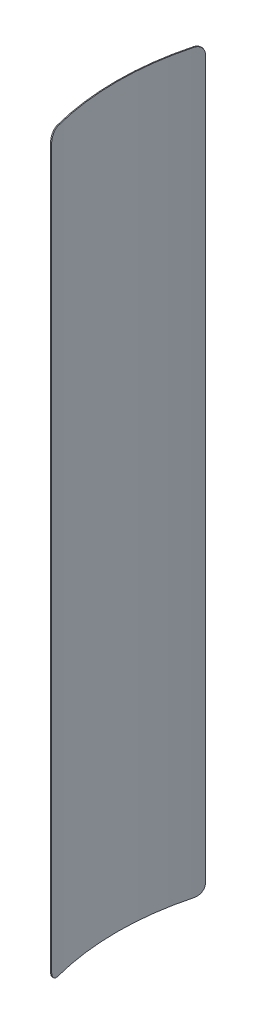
ISO-10303-21;
HEADER;
FILE_DESCRIPTION(('STEP AP214'),'2;1');
FILE_NAME('part.step','',(''),(''),'','','');
FILE_SCHEMA(('AUTOMOTIVE_DESIGN { 1 0 10303 214 1 1 1 1 }'));
ENDSEC;
DATA;
#1=APPLICATION_CONTEXT('core data for automotive mechanical design processes');
#2=APPLICATION_PROTOCOL_DEFINITION('international standard','automotive_design',2000,#1);
#3=PRODUCT_CONTEXT('',#1,'mechanical');
#4=PRODUCT('Part','Part','',(#3));
#5=PRODUCT_RELATED_PRODUCT_CATEGORY('part','',(#4));
#6=PRODUCT_DEFINITION_FORMATION('','',#4);
#7=PRODUCT_DEFINITION_CONTEXT('part definition',#1,'design');
#8=PRODUCT_DEFINITION('design','',#6,#7);
#9=PRODUCT_DEFINITION_SHAPE('','',#8);
#10=(LENGTH_UNIT() NAMED_UNIT(*) SI_UNIT(.MILLI.,.METRE.));
#11=(NAMED_UNIT(*) PLANE_ANGLE_UNIT() SI_UNIT($,.RADIAN.));
#12=(NAMED_UNIT(*) SI_UNIT($,.STERADIAN.) SOLID_ANGLE_UNIT());
#13=UNCERTAINTY_MEASURE_WITH_UNIT(LENGTH_MEASURE(1.E-05),#10,'distance_accuracy_value','');
#14=(GEOMETRIC_REPRESENTATION_CONTEXT(3) GLOBAL_UNCERTAINTY_ASSIGNED_CONTEXT((#13)) GLOBAL_UNIT_ASSIGNED_CONTEXT((#10,
#11,#12)) REPRESENTATION_CONTEXT('',''));
#15=CARTESIAN_POINT('',(0.,0.,0.));
#16=DIRECTION('',(0.,0.,1.));
#17=DIRECTION('',(1.,0.,0.));
#18=AXIS2_PLACEMENT_3D('',#15,#16,#17);
#19=CARTESIAN_POINT('',(0.,-127.,0.));
#20=DIRECTION('',(0.,1.,0.));
#21=DIRECTION('',(0.,0.,1.));
#22=AXIS2_PLACEMENT_3D('',#19,#20,#21);
#23=CYLINDRICAL_SURFACE('',#22,91.6952);
#24=DIRECTION('',(0.,1.,0.));
#25=VECTOR('',#24,1.);
#26=CARTESIAN_POINT('',(-87.778234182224,-127.,26.5139832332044));
#27=LINE('',#26,#25);
#28=CARTESIAN_POINT('',(-87.778234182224,-123.825,26.5139832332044));
#29=VERTEX_POINT('',#28);
#30=CARTESIAN_POINT('',(-87.778234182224,123.825,26.5139832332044));
#31=VERTEX_POINT('',#30);
#32=EDGE_CURVE('E130',#29,#31,#27,.T.);
#33=ORIENTED_EDGE('',*,*,#32,.F.);
#34=CARTESIAN_POINT('',(-87.778234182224,-123.825,26.5139832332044));
#35=CARTESIAN_POINT('',(-87.7782307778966,-123.914300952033,26.5139911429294));
#36=CARTESIAN_POINT('',(-87.7793235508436,-124.003597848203,26.5103766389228));
#37=CARTESIAN_POINT('',(-87.7836755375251,-124.181552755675,26.4959641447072));
#38=CARTESIAN_POINT('',(-87.7869346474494,-124.270210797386,26.4851664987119));
#39=CARTESIAN_POINT('',(-87.7955901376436,-124.446199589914,26.4564598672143));
#40=CARTESIAN_POINT('',(-87.8009849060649,-124.533531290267,26.4385562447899));
#41=CARTESIAN_POINT('',(-87.813854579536,-124.706287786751,26.3957788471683));
#42=CARTESIAN_POINT('',(-87.8213294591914,-124.791712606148,26.3709051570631));
#43=CARTESIAN_POINT('',(-87.8467886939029,-125.044302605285,26.2860222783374));
#44=CARTESIAN_POINT('',(-87.8678112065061,-125.207854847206,26.2157395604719));
#45=CARTESIAN_POINT('',(-87.9171399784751,-125.52020136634,26.0498298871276));
#46=CARTESIAN_POINT('',(-87.9454449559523,-125.668998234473,25.9542073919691));
#47=CARTESIAN_POINT('',(-88.0083082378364,-125.947754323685,25.7402366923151));
#48=CARTESIAN_POINT('',(-88.0428661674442,-126.077714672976,25.621889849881));
#49=CARTESIAN_POINT('',(-88.1170082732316,-126.315110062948,25.3657306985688));
#50=CARTESIAN_POINT('',(-88.1565934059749,-126.42254080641,25.2279146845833));
#51=CARTESIAN_POINT('',(-88.2394100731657,-126.611800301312,24.9367020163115));
#52=CARTESIAN_POINT('',(-88.2826415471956,-126.69362947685,24.7833056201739));
#53=CARTESIAN_POINT('',(-88.3713101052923,-126.829338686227,24.4652494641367));
#54=CARTESIAN_POINT('',(-88.416745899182,-126.883234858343,24.3005962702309));
#55=CARTESIAN_POINT('',(-88.4926818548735,-126.948203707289,24.0222419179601));
#56=CARTESIAN_POINT('',(-88.5229790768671,-126.967616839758,23.9103605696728));
#57=CARTESIAN_POINT('',(-88.583474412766,-126.993513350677,23.6852583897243));
#58=CARTESIAN_POINT('',(-88.6136726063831,-127.000015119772,23.5720396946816));
#59=CARTESIAN_POINT('',(-88.6436605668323,-127.,23.458711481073));
#60=B_SPLINE_CURVE_WITH_KNOTS('',3,(#34,#35,#36,#37,#38,#39,#40,#41,#42,#43,#44,#45,#46,#47,#48,
#49,#50,#51,#52,#53,#54,#55,#56,#57,#58,#59),.UNSPECIFIED.,.F.,.F.,(4,2,2,2,2,2,2,2,2,2,2,2,4),
(0.,0.267815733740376,0.535618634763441,0.803219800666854,1.07081769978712,1.60579855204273,
2.1406852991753,2.67553999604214,3.21049661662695,3.74544437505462,4.28008272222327,
4.63198829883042,4.98339226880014),.UNSPECIFIED.);
#61=CARTESIAN_POINT('',(-88.6436605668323,-127.,23.458711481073));
#62=VERTEX_POINT('',#61);
#63=EDGE_CURVE('E134',#29,#62,#60,.T.);
#64=ORIENTED_EDGE('',*,*,#63,.T.);
#65=CARTESIAN_POINT('',(0.,-127.,0.));
#66=DIRECTION('',(0.,-1.,0.));
#67=DIRECTION('',(0.,0.,1.));
#68=AXIS2_PLACEMENT_3D('',#65,#66,#67);
#69=CIRCLE('',#68,91.6952);
#70=CARTESIAN_POINT('',(-88.6436605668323,-127.,-23.458711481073));
#71=VERTEX_POINT('',#70);
#72=EDGE_CURVE('E224',#62,#71,#69,.T.);
#73=ORIENTED_EDGE('',*,*,#72,.T.);
#74=CARTESIAN_POINT('',(-88.6436605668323,-127.,-23.458711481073));
#75=CARTESIAN_POINT('',(-88.6208166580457,-127.000008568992,-23.5450369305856));
#76=CARTESIAN_POINT('',(-88.5978452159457,-126.996237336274,-23.6313246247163));
#77=CARTESIAN_POINT('',(-88.5518175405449,-126.981199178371,-23.8032176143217));
#78=CARTESIAN_POINT('',(-88.5287613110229,-126.969932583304,-23.8888229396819));
#79=CARTESIAN_POINT('',(-88.4827494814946,-126.939978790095,-24.0586885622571));
#80=CARTESIAN_POINT('',(-88.459793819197,-126.921297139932,-24.1429498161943));
#81=CARTESIAN_POINT('',(-88.4141501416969,-126.876662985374,-24.309570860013));
#82=CARTESIAN_POINT('',(-88.3914621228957,-126.850710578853,-24.3919306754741));
#83=CARTESIAN_POINT('',(-88.3240418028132,-126.762153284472,-24.6353723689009));
#84=CARTESIAN_POINT('',(-88.2799353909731,-126.688836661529,-24.7928822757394));
#85=CARTESIAN_POINT('',(-88.1949606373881,-126.515831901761,-25.0934874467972));
#86=CARTESIAN_POINT('',(-88.1540917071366,-126.416148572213,-25.2365853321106));
#87=CARTESIAN_POINT('',(-88.0769608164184,-126.193240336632,-25.5044723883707));
#88=CARTESIAN_POINT('',(-88.0406973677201,-126.070023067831,-25.6292674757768));
#89=CARTESIAN_POINT('',(-87.9740459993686,-125.803497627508,-25.8571281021));
#90=CARTESIAN_POINT('',(-87.9436592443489,-125.660185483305,-25.9601893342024));
#91=CARTESIAN_POINT('',(-87.889865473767,-125.357524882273,-26.1417338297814));
#92=CARTESIAN_POINT('',(-87.8664607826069,-125.198171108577,-26.2202089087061));
#93=CARTESIAN_POINT('',(-87.8275244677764,-124.868010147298,-26.3503375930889));
#94=CARTESIAN_POINT('',(-87.8119882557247,-124.69720970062,-26.4020068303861));
#95=CARTESIAN_POINT('',(-87.7932282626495,-124.408642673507,-26.4643049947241));
#96=CARTESIAN_POINT('',(-87.7876115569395,-124.292687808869,-26.4829237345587));
#97=CARTESIAN_POINT('',(-87.7801136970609,-124.059504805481,-26.5077609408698));
#98=CARTESIAN_POINT('',(-87.7782272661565,-123.942278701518,-26.5139969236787));
#99=CARTESIAN_POINT('',(-87.778234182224,-123.825,-26.5139832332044));
#100=B_SPLINE_CURVE_WITH_KNOTS('',3,(#74,#75,#76,#77,#78,#79,#80,#81,#82,#83,#84,#85,#86,#87,
#88,#89,#90,#91,#92,#93,#94,#95,#96,#97,#98,#99),.UNSPECIFIED.,.F.,.F.,(4,2,2,2,2,2,2,2,2,2,2,2,
4),(0.,0.267803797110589,0.535595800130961,0.803187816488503,1.07077623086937,1.60574822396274,
2.14062274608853,2.6753239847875,3.21013108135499,3.74511602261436,4.27978863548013,
4.63183989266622,4.9833927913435),.UNSPECIFIED.);
#101=CARTESIAN_POINT('',(-87.778234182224,-123.825,-26.5139832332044));
#102=VERTEX_POINT('',#101);
#103=EDGE_CURVE('E168',#71,#102,#100,.T.);
#104=ORIENTED_EDGE('',*,*,#103,.T.);
#105=DIRECTION('',(0.,1.,0.));
#106=VECTOR('',#105,1.);
#107=CARTESIAN_POINT('',(-87.778234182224,-127.,-26.5139832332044));
#108=LINE('',#107,#106);
#109=CARTESIAN_POINT('',(-87.778234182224,123.825,-26.5139832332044));
#110=VERTEX_POINT('',#109);
#111=EDGE_CURVE('E232',#102,#110,#108,.T.);
#112=ORIENTED_EDGE('',*,*,#111,.T.);
#113=CARTESIAN_POINT('',(-87.778234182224,123.825,-26.5139832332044));
#114=CARTESIAN_POINT('',(-87.7782307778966,123.914300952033,-26.5139911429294));
#115=CARTESIAN_POINT('',(-87.7793235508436,124.003597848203,-26.5103766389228));
#116=CARTESIAN_POINT('',(-87.7836755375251,124.181552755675,-26.4959641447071));
#117=CARTESIAN_POINT('',(-87.7869346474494,124.270210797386,-26.4851664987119));
#118=CARTESIAN_POINT('',(-87.7955901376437,124.446199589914,-26.4564598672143));
#119=CARTESIAN_POINT('',(-87.8009849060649,124.533531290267,-26.4385562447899));
#120=CARTESIAN_POINT('',(-87.813854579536,124.706287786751,-26.3957788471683));
#121=CARTESIAN_POINT('',(-87.8213294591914,124.791712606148,-26.3709051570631));
#122=CARTESIAN_POINT('',(-87.846788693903,125.044302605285,-26.2860222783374));
#123=CARTESIAN_POINT('',(-87.8678112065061,125.207854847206,-26.2157395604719));
#124=CARTESIAN_POINT('',(-87.9171399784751,125.52020136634,-26.0498298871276));
#125=CARTESIAN_POINT('',(-87.9454449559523,125.668998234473,-25.9542073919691));
#126=CARTESIAN_POINT('',(-88.0083082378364,125.947754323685,-25.7402366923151));
#127=CARTESIAN_POINT('',(-88.0428661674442,126.077714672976,-25.621889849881));
#128=CARTESIAN_POINT('',(-88.1170082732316,126.315110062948,-25.3657306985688));
#129=CARTESIAN_POINT('',(-88.1565934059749,126.42254080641,-25.2279146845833));
#130=CARTESIAN_POINT('',(-88.2394100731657,126.611800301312,-24.9367020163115));
#131=CARTESIAN_POINT('',(-88.2826415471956,126.69362947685,-24.7833056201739));
#132=CARTESIAN_POINT('',(-88.3713101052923,126.829338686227,-24.4652494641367));
#133=CARTESIAN_POINT('',(-88.416745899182,126.883234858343,-24.3005962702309));
#134=CARTESIAN_POINT('',(-88.4926818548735,126.948203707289,-24.0222419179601));
#135=CARTESIAN_POINT('',(-88.5229790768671,126.967616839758,-23.9103605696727));
#136=CARTESIAN_POINT('',(-88.583474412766,126.993513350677,-23.6852583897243));
#137=CARTESIAN_POINT('',(-88.6136726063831,127.000015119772,-23.5720396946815));
#138=CARTESIAN_POINT('',(-88.6436605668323,127.,-23.458711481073));
#139=B_SPLINE_CURVE_WITH_KNOTS('',3,(#113,#114,#115,#116,#117,#118,#119,#120,#121,#122,#123,
#124,#125,#126,#127,#128,#129,#130,#131,#132,#133,#134,#135,#136,#137,#138),.UNSPECIFIED.,.F.,
.F.,(4,2,2,2,2,2,2,2,2,2,2,2,4),(0.,0.267815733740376,0.535618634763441,0.803219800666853,
1.07081769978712,1.60579855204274,2.14068529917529,2.67553999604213,3.21049661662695,
3.74544437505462,4.28008272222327,4.63198829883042,4.98339226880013),.UNSPECIFIED.);
#140=CARTESIAN_POINT('',(-88.6436605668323,127.,-23.458711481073));
#141=VERTEX_POINT('',#140);
#142=EDGE_CURVE('E140',#110,#141,#139,.T.);
#143=ORIENTED_EDGE('',*,*,#142,.T.);
#144=CARTESIAN_POINT('',(0.,127.,0.));
#145=DIRECTION('',(0.,-1.,0.));
#146=DIRECTION('',(0.,0.,1.));
#147=AXIS2_PLACEMENT_3D('',#144,#145,#146);
#148=CIRCLE('',#147,91.6952);
#149=CARTESIAN_POINT('',(-88.6436605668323,127.,23.458711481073));
#150=VERTEX_POINT('',#149);
#151=EDGE_CURVE('E235',#150,#141,#148,.T.);
#152=ORIENTED_EDGE('',*,*,#151,.F.);
#153=CARTESIAN_POINT('',(-88.6436605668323,127.,23.458711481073));
#154=CARTESIAN_POINT('',(-88.6208166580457,127.000008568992,23.5450369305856));
#155=CARTESIAN_POINT('',(-88.5978452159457,126.996237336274,23.6313246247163));
#156=CARTESIAN_POINT('',(-88.5518175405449,126.981199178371,23.8032176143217));
#157=CARTESIAN_POINT('',(-88.528761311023,126.969932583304,23.8888229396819));
#158=CARTESIAN_POINT('',(-88.4827494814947,126.939978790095,24.0586885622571));
#159=CARTESIAN_POINT('',(-88.459793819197,126.921297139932,24.1429498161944));
#160=CARTESIAN_POINT('',(-88.4141501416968,126.876662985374,24.309570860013));
#161=CARTESIAN_POINT('',(-88.3914621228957,126.850710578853,24.3919306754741));
#162=CARTESIAN_POINT('',(-88.3240418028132,126.762153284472,24.6353723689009));
#163=CARTESIAN_POINT('',(-88.2799353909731,126.688836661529,24.7928822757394));
#164=CARTESIAN_POINT('',(-88.1949606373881,126.515831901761,25.0934874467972));
#165=CARTESIAN_POINT('',(-88.1540917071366,126.416148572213,25.2365853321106));
#166=CARTESIAN_POINT('',(-88.0769608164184,126.193240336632,25.5044723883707));
#167=CARTESIAN_POINT('',(-88.0406973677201,126.070023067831,25.6292674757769));
#168=CARTESIAN_POINT('',(-87.9740459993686,125.803497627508,25.8571281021));
#169=CARTESIAN_POINT('',(-87.9436592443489,125.660185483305,25.9601893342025));
#170=CARTESIAN_POINT('',(-87.889865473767,125.357524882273,26.1417338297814));
#171=CARTESIAN_POINT('',(-87.8664607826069,125.198171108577,26.2202089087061));
#172=CARTESIAN_POINT('',(-87.8275244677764,124.868010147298,26.3503375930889));
#173=CARTESIAN_POINT('',(-87.8119882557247,124.69720970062,26.4020068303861));
#174=CARTESIAN_POINT('',(-87.7932282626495,124.408642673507,26.4643049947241));
#175=CARTESIAN_POINT('',(-87.7876115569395,124.292687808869,26.4829237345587));
#176=CARTESIAN_POINT('',(-87.7801136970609,124.059504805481,26.5077609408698));
#177=CARTESIAN_POINT('',(-87.7782272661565,123.942278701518,26.5139969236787));
#178=CARTESIAN_POINT('',(-87.778234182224,123.825,26.5139832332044));
#179=B_SPLINE_CURVE_WITH_KNOTS('',3,(#153,#154,#155,#156,#157,#158,#159,#160,#161,#162,#163,
#164,#165,#166,#167,#168,#169,#170,#171,#172,#173,#174,#175,#176,#177,#178),.UNSPECIFIED.,.F.,
.F.,(4,2,2,2,2,2,2,2,2,2,2,2,4),(0.,0.267803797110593,0.535595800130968,0.803187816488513,
1.07077623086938,1.60574822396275,2.14062274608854,2.67532398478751,3.21013108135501,
3.74511602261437,4.27978863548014,4.6318398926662,4.98339279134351),.UNSPECIFIED.);
#180=EDGE_CURVE('E136',#150,#31,#179,.T.);
#181=ORIENTED_EDGE('',*,*,#180,.T.);
#182=EDGE_LOOP('',(#33,#64,#73,#104,#112,#143,#152,#181));
#183=FACE_BOUND('',#182,.T.);
#184=ADVANCED_FACE('F39',(#183),#23,.F.);
#185=CARTESIAN_POINT('',(-87.778234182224,-127.,26.5139832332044));
#186=DIRECTION('',(0.289153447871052,0.,0.957282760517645));
#187=DIRECTION('',(0.957282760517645,0.,-0.289153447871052));
#188=AXIS2_PLACEMENT_3D('',#185,#186,#187);
#189=PLANE('',#188);
#190=DIRECTION('',(0.,1.,0.));
#191=VECTOR('',#190,1.);
#192=CARTESIAN_POINT('',(-88.0700139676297,-127.,26.6021172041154));
#193=LINE('',#192,#191);
#194=CARTESIAN_POINT('',(-88.0700139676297,-123.825,26.6021172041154));
#195=VERTEX_POINT('',#194);
#196=CARTESIAN_POINT('',(-88.0700139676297,123.825,26.6021172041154));
#197=VERTEX_POINT('',#196);
#198=EDGE_CURVE('E111',#195,#197,#193,.T.);
#199=ORIENTED_EDGE('',*,*,#198,.F.);
#200=DIRECTION('',(0.957282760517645,0.,-0.289153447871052));
#201=VECTOR('',#200,1.);
#202=CARTESIAN_POINT('',(-87.778234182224,-123.825,26.5139832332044));
#203=LINE('',#202,#201);
#204=EDGE_CURVE('E125',#195,#29,#203,.T.);
#205=ORIENTED_EDGE('',*,*,#204,.T.);
#206=ORIENTED_EDGE('',*,*,#32,.T.);
#207=DIRECTION('',(0.957282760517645,0.,-0.289153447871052));
#208=VECTOR('',#207,1.);
#209=CARTESIAN_POINT('',(-87.778234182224,123.825,26.5139832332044));
#210=LINE('',#209,#208);
#211=EDGE_CURVE('E128',#31,#197,#210,.F.);
#212=ORIENTED_EDGE('',*,*,#211,.T.);
#213=EDGE_LOOP('',(#199,#205,#206,#212));
#214=FACE_BOUND('',#213,.T.);
#215=ADVANCED_FACE('F123',(#214),#189,.T.);
#216=CARTESIAN_POINT('',(0.,-127.,0.));
#217=DIRECTION('',(0.,1.,0.));
#218=DIRECTION('',(0.,0.,1.));
#219=AXIS2_PLACEMENT_3D('',#216,#217,#218);
#220=CYLINDRICAL_SURFACE('',#219,92.);
#221=CARTESIAN_POINT('',(0.,-127.,0.));
#222=DIRECTION('',(0.,1.,0.));
#223=DIRECTION('',(0.,0.,1.));
#224=AXIS2_PLACEMENT_3D('',#221,#222,#223);
#225=CIRCLE('',#224,92.);
#226=CARTESIAN_POINT('',(-88.9356148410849,-127.,-23.5468981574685));
#227=VERTEX_POINT('',#226);
#228=CARTESIAN_POINT('',(-88.9356148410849,-127.,23.5468981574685));
#229=VERTEX_POINT('',#228);
#230=EDGE_CURVE('E114',#227,#229,#225,.T.);
#231=ORIENTED_EDGE('',*,*,#230,.T.);
#232=CARTESIAN_POINT('',(-88.9356148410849,-127.,23.5468981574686));
#233=CARTESIAN_POINT('',(-88.9127610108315,-127.000008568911,23.6332210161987));
#234=CARTESIAN_POINT('',(-88.8897800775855,-126.996237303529,23.7195062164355));
#235=CARTESIAN_POINT('',(-88.84373432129,-126.981199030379,23.8913944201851));
#236=CARTESIAN_POINT('',(-88.8206695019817,-126.969932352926,23.9769974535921));
#237=CARTESIAN_POINT('',(-88.7746414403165,-126.939978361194,24.1468587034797));
#238=CARTESIAN_POINT('',(-88.7516781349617,-126.921296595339,24.231117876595));
#239=CARTESIAN_POINT('',(-88.7060201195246,-126.876662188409,24.3977349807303));
#240=CARTESIAN_POINT('',(-88.6833254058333,-126.850709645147,24.4800929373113));
#241=CARTESIAN_POINT('',(-88.6158864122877,-126.762151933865,24.7235293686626));
#242=CARTESIAN_POINT('',(-88.5717694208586,-126.688835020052,24.8810362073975));
#243=CARTESIAN_POINT('',(-88.4867769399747,-126.515829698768,25.1816361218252));
#244=CARTESIAN_POINT('',(-88.4459008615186,-126.416146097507,25.3247318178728));
#245=CARTESIAN_POINT('',(-88.3687584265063,-126.193237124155,25.5926155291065));
#246=CARTESIAN_POINT('',(-88.3324905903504,-126.070019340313,25.7174094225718));
#247=CARTESIAN_POINT('',(-88.2658325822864,-125.803492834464,25.9452681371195));
#248=CARTESIAN_POINT('',(-88.235443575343,-125.660180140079,26.0483286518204));
#249=CARTESIAN_POINT('',(-88.1816467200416,-125.357518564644,26.2298718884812));
#250=CARTESIAN_POINT('',(-88.1582411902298,-125.198164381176,26.3083464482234));
#251=CARTESIAN_POINT('',(-88.1193039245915,-124.8680026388,26.4384742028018));
#252=CARTESIAN_POINT('',(-88.1037675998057,-124.697201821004,26.4901430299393));
#253=CARTESIAN_POINT('',(-88.0850077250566,-124.408635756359,26.5524401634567));
#254=CARTESIAN_POINT('',(-88.0793911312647,-124.292682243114,26.5710584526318));
#255=CARTESIAN_POINT('',(-88.0718934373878,-124.059501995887,26.5958950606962));
#256=CARTESIAN_POINT('',(-88.0700070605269,-123.942277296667,26.6021308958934));
#257=CARTESIAN_POINT('',(-88.0700139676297,-123.825,26.6021172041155));
#258=B_SPLINE_CURVE_WITH_KNOTS('',3,(#232,#233,#234,#235,#236,#237,#238,#239,#240,#241,#242,
#243,#244,#245,#246,#247,#248,#249,#250,#251,#252,#253,#254,#255,#256,#257),.UNSPECIFIED.,.F.,
.F.,(4,2,2,2,2,2,2,2,2,2,2,2,4),(0.,0.26780389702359,0.535595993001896,0.803188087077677,
1.07077658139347,1.60574866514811,2.14062329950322,2.67532576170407,3.21013407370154,
3.74511974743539,4.2797930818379,4.63184013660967,4.98338882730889),.UNSPECIFIED.);
#259=EDGE_CURVE('E108',#229,#195,#258,.T.);
#260=ORIENTED_EDGE('',*,*,#259,.T.);
#261=ORIENTED_EDGE('',*,*,#198,.T.);
#262=CARTESIAN_POINT('',(-88.0700139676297,123.825,26.6021172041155));
#263=CARTESIAN_POINT('',(-88.070010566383,123.914300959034,26.6021251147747));
#264=CARTESIAN_POINT('',(-88.0711033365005,124.003597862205,26.598510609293));
#265=CARTESIAN_POINT('',(-88.0754553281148,124.181552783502,26.5840981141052));
#266=CARTESIAN_POINT('',(-88.0787144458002,124.270210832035,26.5733004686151));
#267=CARTESIAN_POINT('',(-88.0873699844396,124.446199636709,26.544593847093));
#268=CARTESIAN_POINT('',(-88.0927647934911,124.533531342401,26.5266902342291));
#269=CARTESIAN_POINT('',(-88.1056346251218,124.706287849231,26.4839128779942));
#270=CARTESIAN_POINT('',(-88.1131096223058,124.791712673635,26.4590392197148));
#271=CARTESIAN_POINT('',(-88.1385694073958,125.044302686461,26.374156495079));
#272=CARTESIAN_POINT('',(-88.159592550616,125.20785493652,26.3038739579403));
#273=CARTESIAN_POINT('',(-88.2089237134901,125.520201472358,26.1379649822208));
#274=CARTESIAN_POINT('',(-88.2372304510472,125.668998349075,26.0423430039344));
#275=CARTESIAN_POINT('',(-88.3000991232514,125.947754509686,25.8283738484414));
#276=CARTESIAN_POINT('',(-88.3346606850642,126.077714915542,25.71002802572));
#277=CARTESIAN_POINT('',(-88.4088126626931,126.315110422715,25.4538716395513));
#278=CARTESIAN_POINT('',(-88.4484040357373,126.422541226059,25.316057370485));
#279=CARTESIAN_POINT('',(-88.5312364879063,126.611800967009,25.0248488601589));
#280=CARTESIAN_POINT('',(-88.5744775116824,126.693630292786,24.8714548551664));
#281=CARTESIAN_POINT('',(-88.6631688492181,126.829339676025,24.5534044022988));
#282=CARTESIAN_POINT('',(-88.7086178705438,126.88323587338,24.3887545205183));
#283=CARTESIAN_POINT('',(-88.7845785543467,126.948204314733,24.1104076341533));
#284=CARTESIAN_POINT('',(-88.8148862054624,126.967617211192,23.9985302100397));
#285=CARTESIAN_POINT('',(-88.8754039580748,126.993513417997,23.7734362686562));
#286=CARTESIAN_POINT('',(-88.9056141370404,127.000015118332,23.6602218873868));
#287=CARTESIAN_POINT('',(-88.9356148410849,127.,23.5468981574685));
#288=B_SPLINE_CURVE_WITH_KNOTS('',3,(#262,#263,#264,#265,#266,#267,#268,#269,#270,#271,#272,
#273,#274,#275,#276,#277,#278,#279,#280,#281,#282,#283,#284,#285,#286,#287),.UNSPECIFIED.,.F.,
.F.,(4,2,2,2,2,2,2,2,2,2,2,2,4),(0.,0.267815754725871,0.535618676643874,0.803219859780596,
1.07081777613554,1.60579866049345,2.14068543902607,2.6755403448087,3.21049719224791,
3.74544592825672,4.28008522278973,4.63198756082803,4.98338830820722),.UNSPECIFIED.);
#289=CARTESIAN_POINT('',(-88.9356148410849,127.,23.5468981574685));
#290=VERTEX_POINT('',#289);
#291=EDGE_CURVE('E208',#197,#290,#288,.T.);
#292=ORIENTED_EDGE('',*,*,#291,.T.);
#293=CARTESIAN_POINT('',(0.,127.,0.));
#294=DIRECTION('',(0.,1.,0.));
#295=DIRECTION('',(0.,0.,1.));
#296=AXIS2_PLACEMENT_3D('',#293,#294,#295);
#297=CIRCLE('',#296,92.);
#298=CARTESIAN_POINT('',(-88.9356148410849,127.,-23.5468981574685));
#299=VERTEX_POINT('',#298);
#300=EDGE_CURVE('E228',#299,#290,#297,.T.);
#301=ORIENTED_EDGE('',*,*,#300,.F.);
#302=CARTESIAN_POINT('',(-88.9356148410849,127.,-23.5468981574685));
#303=CARTESIAN_POINT('',(-88.9127610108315,127.000008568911,-23.6332210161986));
#304=CARTESIAN_POINT('',(-88.8897800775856,126.996237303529,-23.7195062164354));
#305=CARTESIAN_POINT('',(-88.84373432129,126.981199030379,-23.8913944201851));
#306=CARTESIAN_POINT('',(-88.8206695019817,126.969932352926,-23.976997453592));
#307=CARTESIAN_POINT('',(-88.7746414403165,126.939978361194,-24.1468587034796));
#308=CARTESIAN_POINT('',(-88.7516781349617,126.921296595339,-24.231117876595));
#309=CARTESIAN_POINT('',(-88.7060201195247,126.876662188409,-24.3977349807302));
#310=CARTESIAN_POINT('',(-88.6833254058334,126.850709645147,-24.4800929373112));
#311=CARTESIAN_POINT('',(-88.6158864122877,126.762151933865,-24.7235293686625));
#312=CARTESIAN_POINT('',(-88.5717694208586,126.688835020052,-24.8810362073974));
#313=CARTESIAN_POINT('',(-88.4867769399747,126.515829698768,-25.1816361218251));
#314=CARTESIAN_POINT('',(-88.4459008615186,126.416146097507,-25.3247318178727));
#315=CARTESIAN_POINT('',(-88.3687584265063,126.193237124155,-25.5926155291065));
#316=CARTESIAN_POINT('',(-88.3324905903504,126.070019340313,-25.7174094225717));
#317=CARTESIAN_POINT('',(-88.2658325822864,125.803492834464,-25.9452681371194));
#318=CARTESIAN_POINT('',(-88.2354435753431,125.660180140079,-26.0483286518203));
#319=CARTESIAN_POINT('',(-88.1816467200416,125.357518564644,-26.2298718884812));
#320=CARTESIAN_POINT('',(-88.1582411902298,125.198164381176,-26.3083464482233));
#321=CARTESIAN_POINT('',(-88.1193039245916,124.8680026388,-26.4384742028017));
#322=CARTESIAN_POINT('',(-88.1037675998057,124.697201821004,-26.4901430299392));
#323=CARTESIAN_POINT('',(-88.0850077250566,124.408635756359,-26.5524401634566));
#324=CARTESIAN_POINT('',(-88.0793911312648,124.292682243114,-26.5710584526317));
#325=CARTESIAN_POINT('',(-88.0718934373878,124.059501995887,-26.5958950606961));
#326=CARTESIAN_POINT('',(-88.0700070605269,123.942277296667,-26.6021308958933));
#327=CARTESIAN_POINT('',(-88.0700139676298,123.825,-26.6021172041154));
#328=B_SPLINE_CURVE_WITH_KNOTS('',3,(#302,#303,#304,#305,#306,#307,#308,#309,#310,#311,#312,
#313,#314,#315,#316,#317,#318,#319,#320,#321,#322,#323,#324,#325,#326,#327),.UNSPECIFIED.,.F.,
.F.,(4,2,2,2,2,2,2,2,2,2,2,2,4),(0.,0.267803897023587,0.535595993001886,0.80318808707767,
1.07077658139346,1.60574866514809,2.1406232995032,2.67532576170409,3.21013407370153,
3.7451197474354,4.2797930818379,4.63184013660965,4.98338882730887),.UNSPECIFIED.);
#329=CARTESIAN_POINT('',(-88.0700139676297,123.825,-26.6021172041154));
#330=VERTEX_POINT('',#329);
#331=EDGE_CURVE('E56',#299,#330,#328,.T.);
#332=ORIENTED_EDGE('',*,*,#331,.T.);
#333=DIRECTION('',(0.,1.,0.));
#334=VECTOR('',#333,1.);
#335=CARTESIAN_POINT('',(-88.0700139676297,-127.,-26.6021172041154));
#336=LINE('',#335,#334);
#337=CARTESIAN_POINT('',(-88.0700139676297,-123.825,-26.6021172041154));
#338=VERTEX_POINT('',#337);
#339=EDGE_CURVE('E131',#338,#330,#336,.T.);
#340=ORIENTED_EDGE('',*,*,#339,.F.);
#341=CARTESIAN_POINT('',(-88.0700139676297,-123.825,-26.6021172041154));
#342=CARTESIAN_POINT('',(-88.070010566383,-123.914300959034,-26.6021251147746));
#343=CARTESIAN_POINT('',(-88.0711033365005,-124.003597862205,-26.598510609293));
#344=CARTESIAN_POINT('',(-88.0754553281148,-124.181552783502,-26.5840981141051));
#345=CARTESIAN_POINT('',(-88.0787144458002,-124.270210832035,-26.5733004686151));
#346=CARTESIAN_POINT('',(-88.0873699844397,-124.446199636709,-26.5445938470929));
#347=CARTESIAN_POINT('',(-88.0927647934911,-124.533531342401,-26.526690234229));
#348=CARTESIAN_POINT('',(-88.1056346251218,-124.706287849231,-26.4839128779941));
#349=CARTESIAN_POINT('',(-88.1131096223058,-124.791712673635,-26.4590392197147));
#350=CARTESIAN_POINT('',(-88.1385694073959,-125.044302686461,-26.3741564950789));
#351=CARTESIAN_POINT('',(-88.159592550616,-125.20785493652,-26.3038739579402));
#352=CARTESIAN_POINT('',(-88.2089237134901,-125.520201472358,-26.1379649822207));
#353=CARTESIAN_POINT('',(-88.2372304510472,-125.668998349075,-26.0423430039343));
#354=CARTESIAN_POINT('',(-88.3000991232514,-125.947754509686,-25.8283738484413));
#355=CARTESIAN_POINT('',(-88.3346606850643,-126.077714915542,-25.7100280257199));
#356=CARTESIAN_POINT('',(-88.4088126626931,-126.315110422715,-25.4538716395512));
#357=CARTESIAN_POINT('',(-88.4484040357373,-126.422541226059,-25.3160573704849));
#358=CARTESIAN_POINT('',(-88.5312364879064,-126.611800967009,-25.0248488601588));
#359=CARTESIAN_POINT('',(-88.5744775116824,-126.693630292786,-24.8714548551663));
#360=CARTESIAN_POINT('',(-88.6631688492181,-126.829339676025,-24.5534044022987));
#361=CARTESIAN_POINT('',(-88.7086178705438,-126.88323587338,-24.3887545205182));
#362=CARTESIAN_POINT('',(-88.7845785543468,-126.948204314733,-24.1104076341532));
#363=CARTESIAN_POINT('',(-88.8148862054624,-126.967617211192,-23.9985302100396));
#364=CARTESIAN_POINT('',(-88.8754039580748,-126.993513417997,-23.7734362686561));
#365=CARTESIAN_POINT('',(-88.9056141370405,-127.000015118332,-23.6602218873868));
#366=CARTESIAN_POINT('',(-88.9356148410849,-127.,-23.5468981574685));
#367=B_SPLINE_CURVE_WITH_KNOTS('',3,(#341,#342,#343,#344,#345,#346,#347,#348,#349,#350,#351,
#352,#353,#354,#355,#356,#357,#358,#359,#360,#361,#362,#363,#364,#365,#366),.UNSPECIFIED.,.F.,
.F.,(4,2,2,2,2,2,2,2,2,2,2,2,4),(0.,0.267815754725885,0.535618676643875,0.803219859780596,
1.07081777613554,1.60579866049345,2.14068543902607,2.6755403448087,3.21049719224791,
3.74544592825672,4.28008522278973,4.63198756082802,4.98338830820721),.UNSPECIFIED.);
#368=EDGE_CURVE('E64',#338,#227,#367,.T.);
#369=ORIENTED_EDGE('',*,*,#368,.T.);
#370=EDGE_LOOP('',(#231,#260,#261,#292,#301,#332,#340,#369));
#371=FACE_BOUND('',#370,.T.);
#372=ADVANCED_FACE('F110',(#371),#220,.T.);
#373=CARTESIAN_POINT('',(-87.778234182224,-127.,-26.5139832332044));
#374=DIRECTION('',(0.289153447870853,0.,-0.957282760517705));
#375=DIRECTION('',(-0.957282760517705,0.,-0.289153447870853));
#376=AXIS2_PLACEMENT_3D('',#373,#374,#375);
#377=PLANE('',#376);
#378=ORIENTED_EDGE('',*,*,#111,.F.);
#379=DIRECTION('',(-0.957282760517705,0.,-0.289153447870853));
#380=VECTOR('',#379,1.);
#381=CARTESIAN_POINT('',(-88.0700139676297,-123.825,-26.6021172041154));
#382=LINE('',#381,#380);
#383=EDGE_CURVE('E260',#102,#338,#382,.T.);
#384=ORIENTED_EDGE('',*,*,#383,.T.);
#385=ORIENTED_EDGE('',*,*,#339,.T.);
#386=DIRECTION('',(-0.957282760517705,0.,-0.289153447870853));
#387=VECTOR('',#386,1.);
#388=CARTESIAN_POINT('',(-87.778234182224,123.825,-26.5139832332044));
#389=LINE('',#388,#387);
#390=EDGE_CURVE('E119',#330,#110,#389,.F.);
#391=ORIENTED_EDGE('',*,*,#390,.T.);
#392=EDGE_LOOP('',(#378,#384,#385,#391));
#393=FACE_BOUND('',#392,.T.);
#394=ADVANCED_FACE('F160',(#393),#377,.T.);
#395=CARTESIAN_POINT('',(0.,-127.,0.));
#396=DIRECTION('',(0.,1.,0.));
#397=DIRECTION('',(0.,0.,1.));
#398=AXIS2_PLACEMENT_3D('',#395,#396,#397);
#399=PLANE('',#398);
#400=ORIENTED_EDGE('',*,*,#72,.F.);
#401=DIRECTION('',(0.957282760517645,0.,-0.289153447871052));
#402=VECTOR('',#401,1.);
#403=CARTESIAN_POINT('',(-88.9880761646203,-127.,23.5627444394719));
#404=LINE('',#403,#402);
#405=EDGE_CURVE('E216',#62,#229,#404,.F.);
#406=ORIENTED_EDGE('',*,*,#405,.T.);
#407=ORIENTED_EDGE('',*,*,#230,.F.);
#408=DIRECTION('',(-0.957282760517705,0.,-0.289153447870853));
#409=VECTOR('',#408,1.);
#410=CARTESIAN_POINT('',(-88.6962963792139,-127.,-23.4746104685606));
#411=LINE('',#410,#409);
#412=EDGE_CURVE('E218',#227,#71,#411,.F.);
#413=ORIENTED_EDGE('',*,*,#412,.T.);
#414=EDGE_LOOP('',(#400,#406,#407,#413));
#415=FACE_BOUND('',#414,.T.);
#416=ADVANCED_FACE('F226',(#415),#399,.F.);
#417=CARTESIAN_POINT('',(0.,127.,0.));
#418=DIRECTION('',(0.,1.,0.));
#419=DIRECTION('',(0.,0.,1.));
#420=AXIS2_PLACEMENT_3D('',#417,#418,#419);
#421=PLANE('',#420);
#422=ORIENTED_EDGE('',*,*,#151,.T.);
#423=DIRECTION('',(-0.957282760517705,0.,-0.289153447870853));
#424=VECTOR('',#423,1.);
#425=CARTESIAN_POINT('',(-0.918062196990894,127.,3.03937276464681));
#426=LINE('',#425,#424);
#427=EDGE_CURVE('E11',#141,#299,#426,.T.);
#428=ORIENTED_EDGE('',*,*,#427,.T.);
#429=ORIENTED_EDGE('',*,*,#300,.T.);
#430=DIRECTION('',(0.957282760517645,0.,-0.289153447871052));
#431=VECTOR('',#430,1.);
#432=CARTESIAN_POINT('',(-0.91806219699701,127.,-3.03937276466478));
#433=LINE('',#432,#431);
#434=EDGE_CURVE('E49',#290,#150,#433,.T.);
#435=ORIENTED_EDGE('',*,*,#434,.T.);
#436=EDGE_LOOP('',(#422,#428,#429,#435));
#437=FACE_BOUND('',#436,.T.);
#438=ADVANCED_FACE('F255',(#437),#421,.T.);
#439=CARTESIAN_POINT('',(-88.6962963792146,-123.825,23.4746104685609));
#440=DIRECTION('',(-0.957282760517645,0.,0.289153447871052));
#441=DIRECTION('',(0.289153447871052,0.,0.957282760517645));
#442=AXIS2_PLACEMENT_3D('',#439,#440,#441);
#443=CYLINDRICAL_SURFACE('',#442,3.175);
#444=ORIENTED_EDGE('',*,*,#259,.F.);
#445=ORIENTED_EDGE('',*,*,#405,.F.);
#446=ORIENTED_EDGE('',*,*,#63,.F.);
#447=ORIENTED_EDGE('',*,*,#204,.F.);
#448=EDGE_LOOP('',(#444,#445,#446,#447));
#449=FACE_BOUND('',#448,.T.);
#450=ADVANCED_FACE('F133',(#449),#443,.T.);
#451=CARTESIAN_POINT('',(-88.6962963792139,-123.825,-23.4746104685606));
#452=DIRECTION('',(0.957282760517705,0.,0.289153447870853));
#453=DIRECTION('',(0.289153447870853,0.,-0.957282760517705));
#454=AXIS2_PLACEMENT_3D('',#451,#452,#453);
#455=CYLINDRICAL_SURFACE('',#454,3.175);
#456=ORIENTED_EDGE('',*,*,#103,.F.);
#457=ORIENTED_EDGE('',*,*,#412,.F.);
#458=ORIENTED_EDGE('',*,*,#368,.F.);
#459=ORIENTED_EDGE('',*,*,#383,.F.);
#460=EDGE_LOOP('',(#456,#457,#458,#459));
#461=FACE_BOUND('',#460,.T.);
#462=ADVANCED_FACE('F179',(#461),#455,.T.);
#463=CARTESIAN_POINT('',(-0.918062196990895,123.825,3.03937276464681));
#464=DIRECTION('',(-0.957282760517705,0.,-0.289153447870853));
#465=DIRECTION('',(-0.289153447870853,0.,0.957282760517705));
#466=AXIS2_PLACEMENT_3D('',#463,#464,#465);
#467=CYLINDRICAL_SURFACE('',#466,3.175);
#468=ORIENTED_EDGE('',*,*,#142,.F.);
#469=ORIENTED_EDGE('',*,*,#390,.F.);
#470=ORIENTED_EDGE('',*,*,#331,.F.);
#471=ORIENTED_EDGE('',*,*,#427,.F.);
#472=EDGE_LOOP('',(#468,#469,#470,#471));
#473=FACE_BOUND('',#472,.T.);
#474=ADVANCED_FACE('F182',(#473),#467,.T.);
#475=CARTESIAN_POINT('',(-0.918062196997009,123.825,-3.03937276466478));
#476=DIRECTION('',(0.957282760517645,0.,-0.289153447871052));
#477=DIRECTION('',(-0.289153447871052,0.,-0.957282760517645));
#478=AXIS2_PLACEMENT_3D('',#475,#476,#477);
#479=CYLINDRICAL_SURFACE('',#478,3.175);
#480=ORIENTED_EDGE('',*,*,#291,.F.);
#481=ORIENTED_EDGE('',*,*,#211,.F.);
#482=ORIENTED_EDGE('',*,*,#180,.F.);
#483=ORIENTED_EDGE('',*,*,#434,.F.);
#484=EDGE_LOOP('',(#480,#481,#482,#483));
#485=FACE_BOUND('',#484,.T.);
#486=ADVANCED_FACE('F41',(#485),#479,.T.);
#487=CLOSED_SHELL('',(#184,#215,#372,#394,#416,#438,#450,#462,#474,#486));
#488=MANIFOLD_SOLID_BREP('B2',#487);
#489=ADVANCED_BREP_SHAPE_REPRESENTATION('',(#18,#488),#14);
#490=SHAPE_DEFINITION_REPRESENTATION(#9,#489);
ENDSEC;
END-ISO-10303-21;
